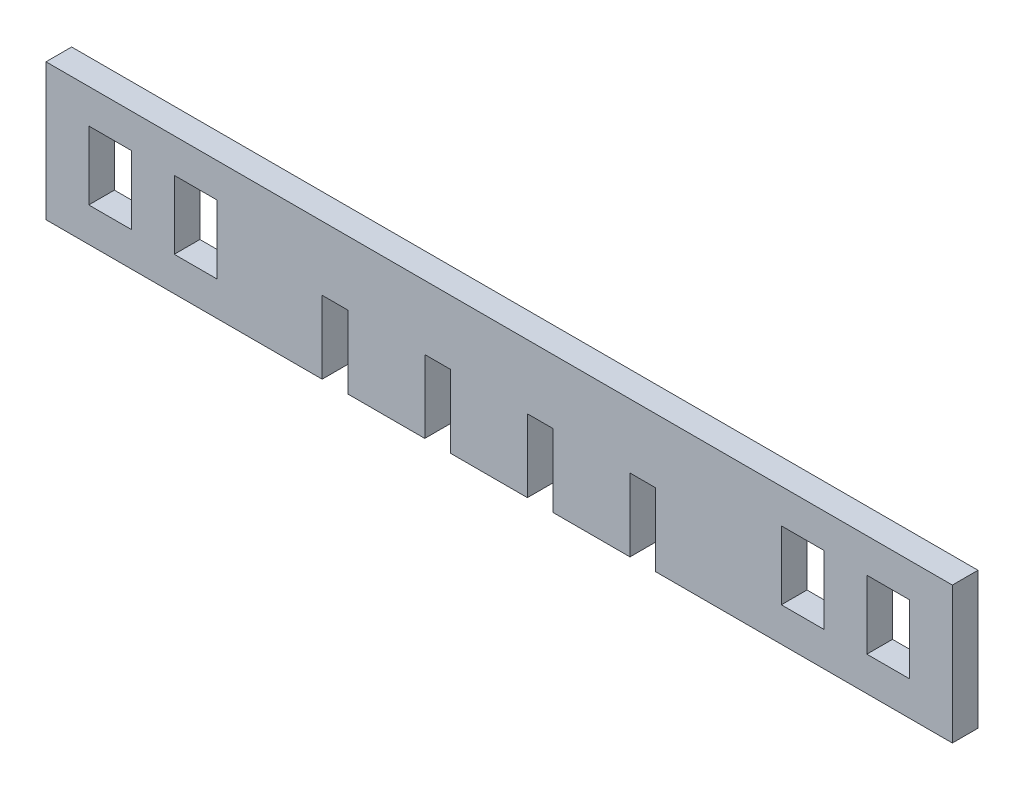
from build123d import *

# Parameters (mm, degrees)
SKETCH1_W           = 5
SKETCH1_H           = 8
BOSS_EXTRUDE1_DEPTH = 3


with BuildPart() as part:
    # Sketch1 → Boss-Extrude1 (new body)
    with BuildSketch(Plane.XY):
        Polygon((-53, -8), (-20.7, -8), (-20.7, 0.5), (-17.7, 0.5), (-17.7, -8), (-8.7, -8), (-8.7, 0.5), (-5.7, 0.5), (-5.7, -8), (3.3, -8), (3.3, 0.5), (6.3, 0.5), (6.3, -8), (15.3, -8), (15.3, 0.5), (18.3, 0.5), (18.3, -8), (53, -8), (53, 8), (-53, 8), align=None)
        with Locations((45.5, 0)):
            Rectangle(SKETCH1_W, SKETCH1_H, mode=Mode.SUBTRACT)
        with Locations((-45.5, 0)):
            Rectangle(SKETCH1_W, SKETCH1_H, mode=Mode.SUBTRACT)
        with Locations((-35.5, 0)):
            Rectangle(SKETCH1_W, SKETCH1_H, mode=Mode.SUBTRACT)
        with Locations((35.5, 0)):
            Rectangle(SKETCH1_W, SKETCH1_H, mode=Mode.SUBTRACT)
    extrude(amount=BOSS_EXTRUDE1_DEPTH)


solid = part.part
